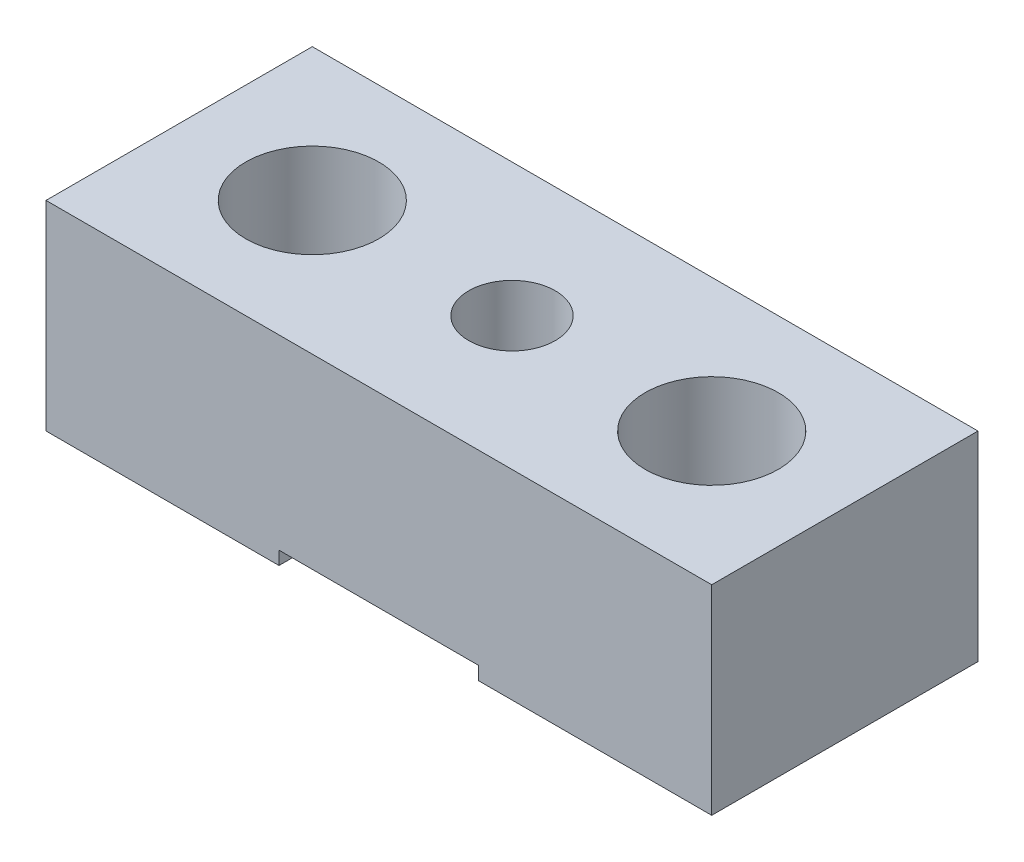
ISO-10303-21;
HEADER;
FILE_DESCRIPTION(('STEP AP214'),'2;1');
FILE_NAME('part.step','',(''),(''),'','','');
FILE_SCHEMA(('AUTOMOTIVE_DESIGN { 1 0 10303 214 1 1 1 1 }'));
ENDSEC;
DATA;
#1=APPLICATION_CONTEXT('core data for automotive mechanical design processes');
#2=APPLICATION_PROTOCOL_DEFINITION('international standard','automotive_design',2000,#1);
#3=PRODUCT_CONTEXT('',#1,'mechanical');
#4=PRODUCT('Part','Part','',(#3));
#5=PRODUCT_RELATED_PRODUCT_CATEGORY('part','',(#4));
#6=PRODUCT_DEFINITION_FORMATION('','',#4);
#7=PRODUCT_DEFINITION_CONTEXT('part definition',#1,'design');
#8=PRODUCT_DEFINITION('design','',#6,#7);
#9=PRODUCT_DEFINITION_SHAPE('','',#8);
#10=(LENGTH_UNIT() NAMED_UNIT(*) SI_UNIT(.MILLI.,.METRE.));
#11=(NAMED_UNIT(*) PLANE_ANGLE_UNIT() SI_UNIT($,.RADIAN.));
#12=(NAMED_UNIT(*) SI_UNIT($,.STERADIAN.) SOLID_ANGLE_UNIT());
#13=UNCERTAINTY_MEASURE_WITH_UNIT(LENGTH_MEASURE(1.E-05),#10,'distance_accuracy_value','');
#14=(GEOMETRIC_REPRESENTATION_CONTEXT(3) GLOBAL_UNCERTAINTY_ASSIGNED_CONTEXT((#13)) GLOBAL_UNIT_ASSIGNED_CONTEXT((#10,
#11,#12)) REPRESENTATION_CONTEXT('',''));
#15=CARTESIAN_POINT('',(0.,0.,0.));
#16=DIRECTION('',(0.,0.,1.));
#17=DIRECTION('',(1.,0.,0.));
#18=AXIS2_PLACEMENT_3D('',#15,#16,#17);
#19=CARTESIAN_POINT('',(0.,-14.9999999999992,10.));
#20=DIRECTION('',(1.,0.,0.));
#21=DIRECTION('',(0.,0.,-1.));
#22=AXIS2_PLACEMENT_3D('',#19,#20,#21);
#23=PLANE('',#22);
#24=DIRECTION('',(0.,-1.,0.));
#25=VECTOR('',#24,1.);
#26=CARTESIAN_POINT('',(0.,-14.9999999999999,-10.));
#27=LINE('',#26,#25);
#28=CARTESIAN_POINT('',(0.,0.,-10.));
#29=VERTEX_POINT('',#28);
#30=CARTESIAN_POINT('',(0.,-14.9999999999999,-10.));
#31=VERTEX_POINT('',#30);
#32=EDGE_CURVE('E107',#29,#31,#27,.T.);
#33=ORIENTED_EDGE('',*,*,#32,.T.);
#34=DIRECTION('',(0.,0.,-1.));
#35=VECTOR('',#34,1.);
#36=CARTESIAN_POINT('',(0.,-14.9999999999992,10.));
#37=LINE('',#36,#35);
#38=CARTESIAN_POINT('',(0.,-14.9999999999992,10.));
#39=VERTEX_POINT('',#38);
#40=EDGE_CURVE('E11',#39,#31,#37,.T.);
#41=ORIENTED_EDGE('',*,*,#40,.F.);
#42=DIRECTION('',(0.,-1.,0.));
#43=VECTOR('',#42,1.);
#44=CARTESIAN_POINT('',(0.,-14.9999999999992,10.));
#45=LINE('',#44,#43);
#46=CARTESIAN_POINT('',(0.,6.66133814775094E-13,10.));
#47=VERTEX_POINT('',#46);
#48=EDGE_CURVE('E149',#47,#39,#45,.T.);
#49=ORIENTED_EDGE('',*,*,#48,.F.);
#50=DIRECTION('',(0.,0.,-1.));
#51=VECTOR('',#50,1.);
#52=CARTESIAN_POINT('',(0.,6.66133814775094E-13,10.));
#53=LINE('',#52,#51);
#54=EDGE_CURVE('E121',#47,#29,#53,.T.);
#55=ORIENTED_EDGE('',*,*,#54,.T.);
#56=EDGE_LOOP('',(#33,#41,#49,#55));
#57=FACE_BOUND('',#56,.T.);
#58=ADVANCED_FACE('F38',(#57),#23,.F.);
#59=CARTESIAN_POINT('',(17.5,-14.9999999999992,10.));
#60=DIRECTION('',(0.,1.,0.));
#61=DIRECTION('',(-1.,0.,0.));
#62=AXIS2_PLACEMENT_3D('',#59,#60,#61);
#63=PLANE('',#62);
#64=CARTESIAN_POINT('',(10.,-14.9999999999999,0.));
#65=DIRECTION('',(0.,1.,0.));
#66=DIRECTION('',(-1.,0.,0.));
#67=AXIS2_PLACEMENT_3D('',#64,#65,#66);
#68=CIRCLE('',#67,5.);
#69=CARTESIAN_POINT('',(10.,-14.9999999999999,5.));
#70=VERTEX_POINT('',#69);
#71=EDGE_CURVE('E123',#70,#70,#68,.F.);
#72=ORIENTED_EDGE('',*,*,#71,.F.);
#73=EDGE_LOOP('',(#72));
#74=FACE_BOUND('',#73,.T.);
#75=DIRECTION('',(1.,0.,0.));
#76=VECTOR('',#75,1.);
#77=CARTESIAN_POINT('',(17.5,-14.9999999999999,-10.));
#78=LINE('',#77,#76);
#79=CARTESIAN_POINT('',(17.5,-14.9999999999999,-10.));
#80=VERTEX_POINT('',#79);
#81=EDGE_CURVE('E103',#31,#80,#78,.T.);
#82=ORIENTED_EDGE('',*,*,#81,.T.);
#83=DIRECTION('',(0.,0.,-1.));
#84=VECTOR('',#83,1.);
#85=CARTESIAN_POINT('',(17.5,-14.9999999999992,10.));
#86=LINE('',#85,#84);
#87=CARTESIAN_POINT('',(17.5,-14.9999999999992,10.));
#88=VERTEX_POINT('',#87);
#89=EDGE_CURVE('E46',#88,#80,#86,.T.);
#90=ORIENTED_EDGE('',*,*,#89,.F.);
#91=DIRECTION('',(1.,0.,0.));
#92=VECTOR('',#91,1.);
#93=CARTESIAN_POINT('',(17.5,-14.9999999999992,10.));
#94=LINE('',#93,#92);
#95=EDGE_CURVE('E117',#39,#88,#94,.T.);
#96=ORIENTED_EDGE('',*,*,#95,.F.);
#97=ORIENTED_EDGE('',*,*,#40,.T.);
#98=EDGE_LOOP('',(#82,#90,#96,#97));
#99=FACE_BOUND('',#98,.T.);
#100=ADVANCED_FACE('F116',(#74,#99),#63,.F.);
#101=CARTESIAN_POINT('',(17.5,-13.9999999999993,10.));
#102=DIRECTION('',(-1.,0.,0.));
#103=DIRECTION('',(0.,0.,1.));
#104=AXIS2_PLACEMENT_3D('',#101,#102,#103);
#105=PLANE('',#104);
#106=DIRECTION('',(0.,1.,0.));
#107=VECTOR('',#106,1.);
#108=CARTESIAN_POINT('',(17.5,-14.,-10.));
#109=LINE('',#108,#107);
#110=CARTESIAN_POINT('',(17.5,-14.,-10.));
#111=VERTEX_POINT('',#110);
#112=EDGE_CURVE('E109',#80,#111,#109,.T.);
#113=ORIENTED_EDGE('',*,*,#112,.T.);
#114=DIRECTION('',(0.,0.,-1.));
#115=VECTOR('',#114,1.);
#116=CARTESIAN_POINT('',(17.5,-13.9999999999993,10.));
#117=LINE('',#116,#115);
#118=CARTESIAN_POINT('',(17.5,-13.9999999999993,10.));
#119=VERTEX_POINT('',#118);
#120=EDGE_CURVE('E188',#119,#111,#117,.T.);
#121=ORIENTED_EDGE('',*,*,#120,.F.);
#122=DIRECTION('',(0.,1.,0.));
#123=VECTOR('',#122,1.);
#124=CARTESIAN_POINT('',(17.5,-13.9999999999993,10.));
#125=LINE('',#124,#123);
#126=EDGE_CURVE('E154',#88,#119,#125,.T.);
#127=ORIENTED_EDGE('',*,*,#126,.F.);
#128=ORIENTED_EDGE('',*,*,#89,.T.);
#129=EDGE_LOOP('',(#113,#121,#127,#128));
#130=FACE_BOUND('',#129,.T.);
#131=ADVANCED_FACE('F194',(#130),#105,.F.);
#132=CARTESIAN_POINT('',(32.5,-13.9999999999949,10.));
#133=DIRECTION('',(0.,1.,0.));
#134=DIRECTION('',(-1.,0.,0.));
#135=AXIS2_PLACEMENT_3D('',#132,#133,#134);
#136=PLANE('',#135);
#137=CARTESIAN_POINT('',(25.,-14.,0.));
#138=DIRECTION('',(0.,1.,0.));
#139=DIRECTION('',(-1.,0.,0.));
#140=AXIS2_PLACEMENT_3D('',#137,#138,#139);
#141=CIRCLE('',#140,3.25);
#142=CARTESIAN_POINT('',(25.,-14.,3.25));
#143=VERTEX_POINT('',#142);
#144=EDGE_CURVE('E257',#143,#143,#141,.F.);
#145=ORIENTED_EDGE('',*,*,#144,.F.);
#146=EDGE_LOOP('',(#145));
#147=FACE_BOUND('',#146,.T.);
#148=DIRECTION('',(1.,0.,0.));
#149=VECTOR('',#148,1.);
#150=CARTESIAN_POINT('',(32.5,-13.9999999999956,-10.));
#151=LINE('',#150,#149);
#152=CARTESIAN_POINT('',(32.5,-13.9999999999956,-10.));
#153=VERTEX_POINT('',#152);
#154=EDGE_CURVE('E134',#111,#153,#151,.T.);
#155=ORIENTED_EDGE('',*,*,#154,.T.);
#156=DIRECTION('',(0.,0.,-1.));
#157=VECTOR('',#156,1.);
#158=CARTESIAN_POINT('',(32.5,-13.9999999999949,10.));
#159=LINE('',#158,#157);
#160=CARTESIAN_POINT('',(32.5,-13.9999999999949,10.));
#161=VERTEX_POINT('',#160);
#162=EDGE_CURVE('E184',#161,#153,#159,.T.);
#163=ORIENTED_EDGE('',*,*,#162,.F.);
#164=DIRECTION('',(1.,0.,0.));
#165=VECTOR('',#164,1.);
#166=CARTESIAN_POINT('',(32.5,-13.9999999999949,10.));
#167=LINE('',#166,#165);
#168=EDGE_CURVE('E157',#119,#161,#167,.T.);
#169=ORIENTED_EDGE('',*,*,#168,.F.);
#170=ORIENTED_EDGE('',*,*,#120,.T.);
#171=EDGE_LOOP('',(#155,#163,#169,#170));
#172=FACE_BOUND('',#171,.T.);
#173=ADVANCED_FACE('F202',(#147,#172),#136,.F.);
#174=CARTESIAN_POINT('',(32.5,-13.9999999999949,10.));
#175=DIRECTION('',(1.,0.,0.));
#176=DIRECTION('',(0.,0.,-1.));
#177=AXIS2_PLACEMENT_3D('',#174,#175,#176);
#178=PLANE('',#177);
#179=DIRECTION('',(0.,-1.,0.));
#180=VECTOR('',#179,1.);
#181=CARTESIAN_POINT('',(32.5,-13.9999999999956,-10.));
#182=LINE('',#181,#180);
#183=CARTESIAN_POINT('',(32.5,-14.9999999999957,-10.));
#184=VERTEX_POINT('',#183);
#185=EDGE_CURVE('E137',#153,#184,#182,.T.);
#186=ORIENTED_EDGE('',*,*,#185,.T.);
#187=DIRECTION('',(0.,0.,-1.));
#188=VECTOR('',#187,1.);
#189=CARTESIAN_POINT('',(32.5,-14.999999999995,10.));
#190=LINE('',#189,#188);
#191=CARTESIAN_POINT('',(32.5,-14.999999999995,10.));
#192=VERTEX_POINT('',#191);
#193=EDGE_CURVE('E180',#192,#184,#190,.T.);
#194=ORIENTED_EDGE('',*,*,#193,.F.);
#195=DIRECTION('',(0.,-1.,0.));
#196=VECTOR('',#195,1.);
#197=CARTESIAN_POINT('',(32.5,-13.9999999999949,10.));
#198=LINE('',#197,#196);
#199=EDGE_CURVE('E160',#161,#192,#198,.T.);
#200=ORIENTED_EDGE('',*,*,#199,.F.);
#201=ORIENTED_EDGE('',*,*,#162,.T.);
#202=EDGE_LOOP('',(#186,#194,#200,#201));
#203=FACE_BOUND('',#202,.T.);
#204=ADVANCED_FACE('F205',(#203),#178,.F.);
#205=CARTESIAN_POINT('',(32.5,-14.999999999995,10.));
#206=DIRECTION('',(0.,1.,0.));
#207=DIRECTION('',(-1.,0.,0.));
#208=AXIS2_PLACEMENT_3D('',#205,#206,#207);
#209=PLANE('',#208);
#210=CARTESIAN_POINT('',(40.,-14.9999999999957,0.));
#211=DIRECTION('',(0.,1.,0.));
#212=DIRECTION('',(-1.,0.,0.));
#213=AXIS2_PLACEMENT_3D('',#210,#211,#212);
#214=CIRCLE('',#213,5.);
#215=CARTESIAN_POINT('',(40.,-14.9999999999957,5.));
#216=VERTEX_POINT('',#215);
#217=EDGE_CURVE('E249',#216,#216,#214,.F.);
#218=ORIENTED_EDGE('',*,*,#217,.F.);
#219=EDGE_LOOP('',(#218));
#220=FACE_BOUND('',#219,.T.);
#221=DIRECTION('',(1.,0.,0.));
#222=VECTOR('',#221,1.);
#223=CARTESIAN_POINT('',(32.5,-14.9999999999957,-10.));
#224=LINE('',#223,#222);
#225=CARTESIAN_POINT('',(50.,-14.9999999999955,-10.));
#226=VERTEX_POINT('',#225);
#227=EDGE_CURVE('E140',#184,#226,#224,.T.);
#228=ORIENTED_EDGE('',*,*,#227,.T.);
#229=DIRECTION('',(0.,0.,-1.));
#230=VECTOR('',#229,1.);
#231=CARTESIAN_POINT('',(50.,-14.9999999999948,10.));
#232=LINE('',#231,#230);
#233=CARTESIAN_POINT('',(50.,-14.9999999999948,10.));
#234=VERTEX_POINT('',#233);
#235=EDGE_CURVE('E176',#234,#226,#232,.T.);
#236=ORIENTED_EDGE('',*,*,#235,.F.);
#237=DIRECTION('',(1.,0.,0.));
#238=VECTOR('',#237,1.);
#239=CARTESIAN_POINT('',(32.5,-14.999999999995,10.));
#240=LINE('',#239,#238);
#241=EDGE_CURVE('E163',#192,#234,#240,.T.);
#242=ORIENTED_EDGE('',*,*,#241,.F.);
#243=ORIENTED_EDGE('',*,*,#193,.T.);
#244=EDGE_LOOP('',(#228,#236,#242,#243));
#245=FACE_BOUND('',#244,.T.);
#246=ADVANCED_FACE('F210',(#220,#245),#209,.F.);
#247=CARTESIAN_POINT('',(50.,5.10702591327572E-12,10.));
#248=DIRECTION('',(-1.,0.,0.));
#249=DIRECTION('',(0.,0.,1.));
#250=AXIS2_PLACEMENT_3D('',#247,#248,#249);
#251=PLANE('',#250);
#252=DIRECTION('',(0.,1.,0.));
#253=VECTOR('',#252,1.);
#254=CARTESIAN_POINT('',(50.,4.44089209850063E-12,-10.));
#255=LINE('',#254,#253);
#256=CARTESIAN_POINT('',(50.,4.44089209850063E-12,-10.));
#257=VERTEX_POINT('',#256);
#258=EDGE_CURVE('E143',#226,#257,#255,.T.);
#259=ORIENTED_EDGE('',*,*,#258,.T.);
#260=DIRECTION('',(0.,0.,-1.));
#261=VECTOR('',#260,1.);
#262=CARTESIAN_POINT('',(50.,5.10702591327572E-12,10.));
#263=LINE('',#262,#261);
#264=CARTESIAN_POINT('',(50.,5.10702591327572E-12,10.));
#265=VERTEX_POINT('',#264);
#266=EDGE_CURVE('E172',#265,#257,#263,.T.);
#267=ORIENTED_EDGE('',*,*,#266,.F.);
#268=DIRECTION('',(0.,1.,0.));
#269=VECTOR('',#268,1.);
#270=CARTESIAN_POINT('',(50.,5.10702591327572E-12,10.));
#271=LINE('',#270,#269);
#272=EDGE_CURVE('E58',#234,#265,#271,.T.);
#273=ORIENTED_EDGE('',*,*,#272,.F.);
#274=ORIENTED_EDGE('',*,*,#235,.T.);
#275=EDGE_LOOP('',(#259,#267,#273,#274));
#276=FACE_BOUND('',#275,.T.);
#277=ADVANCED_FACE('F213',(#276),#251,.F.);
#278=CARTESIAN_POINT('',(0.,6.66133814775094E-13,10.));
#279=DIRECTION('',(0.,-1.,0.));
#280=DIRECTION('',(0.,0.,-1.));
#281=AXIS2_PLACEMENT_3D('',#278,#279,#280);
#282=PLANE('',#281);
#283=CARTESIAN_POINT('',(40.,4.44089209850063E-12,0.));
#284=DIRECTION('',(0.,1.,0.));
#285=DIRECTION('',(0.,0.,1.));
#286=AXIS2_PLACEMENT_3D('',#283,#284,#285);
#287=CIRCLE('',#286,5.);
#288=CARTESIAN_POINT('',(40.,4.4426268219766E-12,4.99999999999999));
#289=VERTEX_POINT('',#288);
#290=EDGE_CURVE('E252',#289,#289,#287,.T.);
#291=ORIENTED_EDGE('',*,*,#290,.F.);
#292=EDGE_LOOP('',(#291));
#293=FACE_BOUND('',#292,.T.);
#294=CARTESIAN_POINT('',(25.,0.,0.));
#295=DIRECTION('',(0.,1.,0.));
#296=DIRECTION('',(0.,0.,1.));
#297=AXIS2_PLACEMENT_3D('',#294,#295,#296);
#298=CIRCLE('',#297,3.25);
#299=CARTESIAN_POINT('',(25.,0.,3.25));
#300=VERTEX_POINT('',#299);
#301=EDGE_CURVE('E251',#300,#300,#298,.T.);
#302=ORIENTED_EDGE('',*,*,#301,.F.);
#303=EDGE_LOOP('',(#302));
#304=FACE_BOUND('',#303,.T.);
#305=CARTESIAN_POINT('',(10.,0.,0.));
#306=DIRECTION('',(0.,1.,0.));
#307=DIRECTION('',(0.,0.,1.));
#308=AXIS2_PLACEMENT_3D('',#305,#306,#307);
#309=CIRCLE('',#308,5.);
#310=CARTESIAN_POINT('',(10.,0.,5.));
#311=VERTEX_POINT('',#310);
#312=EDGE_CURVE('E128',#311,#311,#309,.T.);
#313=ORIENTED_EDGE('',*,*,#312,.F.);
#314=EDGE_LOOP('',(#313));
#315=FACE_BOUND('',#314,.T.);
#316=DIRECTION('',(-1.,0.,0.));
#317=VECTOR('',#316,1.);
#318=CARTESIAN_POINT('',(0.,0.,-10.));
#319=LINE('',#318,#317);
#320=EDGE_CURVE('E146',#257,#29,#319,.T.);
#321=ORIENTED_EDGE('',*,*,#320,.T.);
#322=ORIENTED_EDGE('',*,*,#54,.F.);
#323=DIRECTION('',(-1.,0.,0.));
#324=VECTOR('',#323,1.);
#325=CARTESIAN_POINT('',(0.,6.66133814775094E-13,10.));
#326=LINE('',#325,#324);
#327=EDGE_CURVE('E53',#265,#47,#326,.T.);
#328=ORIENTED_EDGE('',*,*,#327,.F.);
#329=ORIENTED_EDGE('',*,*,#266,.T.);
#330=EDGE_LOOP('',(#321,#322,#328,#329));
#331=FACE_BOUND('',#330,.T.);
#332=ADVANCED_FACE('F215',(#293,#304,#315,#331),#282,.F.);
#333=CARTESIAN_POINT('',(0.,6.66133814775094E-13,10.));
#334=DIRECTION('',(0.,0.,-1.));
#335=DIRECTION('',(-1.,0.,0.));
#336=AXIS2_PLACEMENT_3D('',#333,#334,#335);
#337=PLANE('',#336);
#338=ORIENTED_EDGE('',*,*,#48,.T.);
#339=ORIENTED_EDGE('',*,*,#95,.T.);
#340=ORIENTED_EDGE('',*,*,#126,.T.);
#341=ORIENTED_EDGE('',*,*,#168,.T.);
#342=ORIENTED_EDGE('',*,*,#199,.T.);
#343=ORIENTED_EDGE('',*,*,#241,.T.);
#344=ORIENTED_EDGE('',*,*,#272,.T.);
#345=ORIENTED_EDGE('',*,*,#327,.T.);
#346=EDGE_LOOP('',(#338,#339,#340,#341,#342,#343,#344,#345));
#347=FACE_BOUND('',#346,.T.);
#348=ADVANCED_FACE('F197',(#347),#337,.F.);
#349=CARTESIAN_POINT('',(0.,0.,-10.));
#350=DIRECTION('',(0.,0.,-1.));
#351=DIRECTION('',(-1.,0.,0.));
#352=AXIS2_PLACEMENT_3D('',#349,#350,#351);
#353=PLANE('',#352);
#354=ORIENTED_EDGE('',*,*,#32,.F.);
#355=ORIENTED_EDGE('',*,*,#320,.F.);
#356=ORIENTED_EDGE('',*,*,#258,.F.);
#357=ORIENTED_EDGE('',*,*,#227,.F.);
#358=ORIENTED_EDGE('',*,*,#185,.F.);
#359=ORIENTED_EDGE('',*,*,#154,.F.);
#360=ORIENTED_EDGE('',*,*,#112,.F.);
#361=ORIENTED_EDGE('',*,*,#81,.F.);
#362=EDGE_LOOP('',(#354,#355,#356,#357,#358,#359,#360,#361));
#363=FACE_BOUND('',#362,.T.);
#364=ADVANCED_FACE('F104',(#363),#353,.T.);
#365=CARTESIAN_POINT('',(10.,-15.001,0.));
#366=DIRECTION('',(0.,1.,0.));
#367=DIRECTION('',(0.,0.,1.));
#368=AXIS2_PLACEMENT_3D('',#365,#366,#367);
#369=CYLINDRICAL_SURFACE('',#368,5.);
#370=CARTESIAN_POINT('',(10.,0.,5.));
#371=CARTESIAN_POINT('',(10.,-0.156249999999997,5.));
#372=CARTESIAN_POINT('',(10.,-0.312499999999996,5.));
#373=CARTESIAN_POINT('',(10.,-0.624999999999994,5.));
#374=CARTESIAN_POINT('',(10.,-0.781249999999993,5.));
#375=CARTESIAN_POINT('',(10.,-1.09374999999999,5.));
#376=CARTESIAN_POINT('',(10.,-1.24999999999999,5.));
#377=CARTESIAN_POINT('',(10.,-1.56249999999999,5.));
#378=CARTESIAN_POINT('',(10.,-1.71874999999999,5.));
#379=CARTESIAN_POINT('',(10.,-2.03124999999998,5.));
#380=CARTESIAN_POINT('',(10.,-2.18749999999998,5.));
#381=CARTESIAN_POINT('',(10.,-2.49999999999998,5.));
#382=CARTESIAN_POINT('',(10.,-2.65624999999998,5.));
#383=CARTESIAN_POINT('',(10.,-2.96874999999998,5.));
#384=CARTESIAN_POINT('',(10.,-3.12499999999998,5.));
#385=CARTESIAN_POINT('',(10.,-3.43749999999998,5.));
#386=CARTESIAN_POINT('',(10.,-3.59374999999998,5.));
#387=CARTESIAN_POINT('',(10.,-3.90624999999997,5.));
#388=CARTESIAN_POINT('',(10.,-4.06249999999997,5.));
#389=CARTESIAN_POINT('',(10.,-4.37499999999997,5.));
#390=CARTESIAN_POINT('',(10.,-4.53124999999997,5.));
#391=CARTESIAN_POINT('',(10.,-4.84374999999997,5.));
#392=CARTESIAN_POINT('',(10.,-4.99999999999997,5.));
#393=CARTESIAN_POINT('',(10.,-5.31249999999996,5.));
#394=CARTESIAN_POINT('',(10.,-5.46874999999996,5.));
#395=CARTESIAN_POINT('',(10.,-5.78124999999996,5.));
#396=CARTESIAN_POINT('',(10.,-5.93749999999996,5.));
#397=CARTESIAN_POINT('',(10.,-6.24999999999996,5.));
#398=CARTESIAN_POINT('',(10.,-6.40624999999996,5.));
#399=CARTESIAN_POINT('',(10.,-6.71874999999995,5.));
#400=CARTESIAN_POINT('',(10.,-6.87499999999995,5.));
#401=CARTESIAN_POINT('',(10.,-7.18749999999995,5.));
#402=CARTESIAN_POINT('',(10.,-7.34374999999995,5.));
#403=CARTESIAN_POINT('',(10.,-7.65624999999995,5.));
#404=CARTESIAN_POINT('',(10.,-7.81249999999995,5.));
#405=CARTESIAN_POINT('',(10.,-8.12499999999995,5.));
#406=CARTESIAN_POINT('',(10.,-8.28124999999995,5.));
#407=CARTESIAN_POINT('',(10.,-8.59374999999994,5.));
#408=CARTESIAN_POINT('',(10.,-8.74999999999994,5.));
#409=CARTESIAN_POINT('',(10.,-9.06249999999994,5.));
#410=CARTESIAN_POINT('',(10.,-9.21874999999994,5.));
#411=CARTESIAN_POINT('',(10.,-9.53124999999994,5.));
#412=CARTESIAN_POINT('',(10.,-9.68749999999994,5.));
#413=CARTESIAN_POINT('',(10.,-9.99999999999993,5.));
#414=CARTESIAN_POINT('',(10.,-10.1562499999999,5.));
#415=CARTESIAN_POINT('',(10.,-10.4687499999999,5.));
#416=CARTESIAN_POINT('',(10.,-10.6249999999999,5.));
#417=CARTESIAN_POINT('',(10.,-10.9374999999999,5.));
#418=CARTESIAN_POINT('',(10.,-11.0937499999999,5.));
#419=CARTESIAN_POINT('',(10.,-11.4062499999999,5.));
#420=CARTESIAN_POINT('',(10.,-11.5624999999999,5.));
#421=CARTESIAN_POINT('',(10.,-11.8749999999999,5.));
#422=CARTESIAN_POINT('',(10.,-12.0312499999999,5.));
#423=CARTESIAN_POINT('',(10.,-12.3437499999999,5.));
#424=CARTESIAN_POINT('',(10.,-12.4999999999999,5.));
#425=CARTESIAN_POINT('',(10.,-12.8124999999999,5.));
#426=CARTESIAN_POINT('',(10.,-12.9687499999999,5.));
#427=CARTESIAN_POINT('',(10.,-13.2812499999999,5.));
#428=CARTESIAN_POINT('',(10.,-13.4374999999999,5.));
#429=CARTESIAN_POINT('',(10.,-13.7499999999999,5.));
#430=CARTESIAN_POINT('',(10.,-13.9062499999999,5.));
#431=CARTESIAN_POINT('',(10.,-14.2187499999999,5.));
#432=CARTESIAN_POINT('',(10.,-14.3749999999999,5.));
#433=CARTESIAN_POINT('',(10.,-14.6874999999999,5.));
#434=CARTESIAN_POINT('',(10.,-14.8437499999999,5.));
#435=CARTESIAN_POINT('',(10.,-14.9999999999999,5.));
#436=B_SPLINE_CURVE_WITH_KNOTS('',3,(#370,#371,#372,#373,#374,#375,#376,#377,#378,#379,#380,
#381,#382,#383,#384,#385,#386,#387,#388,#389,#390,#391,#392,#393,#394,#395,#396,#397,#398,#399,
#400,#401,#402,#403,#404,#405,#406,#407,#408,#409,#410,#411,#412,#413,#414,#415,#416,#417,#418,
#419,#420,#421,#422,#423,#424,#425,#426,#427,#428,#429,#430,#431,#432,#433,#434,#435),
.UNSPECIFIED.,.F.,.F.,(4,2,2,2,2,2,2,2,2,2,2,2,2,2,2,2,2,2,2,2,2,2,2,2,2,2,2,2,2,2,2,2,4),(0.,
0.468749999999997,0.937499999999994,1.40624999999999,1.87499999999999,2.34374999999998,
2.81249999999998,3.28124999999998,3.74999999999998,4.21874999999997,4.68749999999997,
5.15624999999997,5.62499999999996,6.09374999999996,6.56249999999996,7.03124999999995,
7.49999999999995,7.96874999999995,8.43749999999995,8.90624999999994,9.37499999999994,
9.84374999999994,10.3124999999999,10.7812499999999,11.2499999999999,11.7187499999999,
12.1874999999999,12.6562499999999,13.1249999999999,13.5937499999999,14.0624999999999,
14.5312499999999,14.9999999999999),.UNSPECIFIED.);
#437=EDGE_CURVE('BSEAM268',#311,#70,#436,.T.);
#438=ORIENTED_EDGE('',*,*,#312,.T.);
#439=ORIENTED_EDGE('',*,*,#71,.T.);
#440=ORIENTED_EDGE('',*,*,#437,.T.);
#441=ORIENTED_EDGE('',*,*,#437,.F.);
#442=EDGE_LOOP('',(#438,#440,#439,#441));
#443=FACE_BOUND('',#442,.T.);
#444=ADVANCED_FACE('F268',(#443),#369,.F.);
#445=CARTESIAN_POINT('',(25.,-15.0009999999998,0.));
#446=DIRECTION('',(0.,1.,0.));
#447=DIRECTION('',(0.,0.,1.));
#448=AXIS2_PLACEMENT_3D('',#445,#446,#447);
#449=CYLINDRICAL_SURFACE('',#448,3.25);
#450=CARTESIAN_POINT('',(25.,0.,3.25));
#451=CARTESIAN_POINT('',(25.,-0.145833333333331,3.25));
#452=CARTESIAN_POINT('',(25.,-0.291666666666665,3.25));
#453=CARTESIAN_POINT('',(25.,-0.583333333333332,3.25));
#454=CARTESIAN_POINT('',(25.,-0.729166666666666,3.25));
#455=CARTESIAN_POINT('',(25.,-1.02083333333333,3.25));
#456=CARTESIAN_POINT('',(25.,-1.16666666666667,3.25));
#457=CARTESIAN_POINT('',(25.,-1.45833333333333,3.25));
#458=CARTESIAN_POINT('',(25.,-1.60416666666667,3.25));
#459=CARTESIAN_POINT('',(25.,-1.89583333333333,3.25));
#460=CARTESIAN_POINT('',(25.,-2.04166666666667,3.25));
#461=CARTESIAN_POINT('',(25.,-2.33333333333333,3.25));
#462=CARTESIAN_POINT('',(25.,-2.47916666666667,3.25));
#463=CARTESIAN_POINT('',(25.,-2.77083333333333,3.25));
#464=CARTESIAN_POINT('',(25.,-2.91666666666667,3.25));
#465=CARTESIAN_POINT('',(25.,-3.20833333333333,3.25));
#466=CARTESIAN_POINT('',(25.,-3.35416666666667,3.25));
#467=CARTESIAN_POINT('',(25.,-3.64583333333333,3.25));
#468=CARTESIAN_POINT('',(25.,-3.79166666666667,3.25));
#469=CARTESIAN_POINT('',(25.,-4.08333333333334,3.25));
#470=CARTESIAN_POINT('',(25.,-4.22916666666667,3.25));
#471=CARTESIAN_POINT('',(25.,-4.52083333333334,3.25));
#472=CARTESIAN_POINT('',(25.,-4.66666666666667,3.25));
#473=CARTESIAN_POINT('',(25.,-4.95833333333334,3.25));
#474=CARTESIAN_POINT('',(25.,-5.10416666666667,3.25));
#475=CARTESIAN_POINT('',(25.,-5.39583333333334,3.25));
#476=CARTESIAN_POINT('',(25.,-5.54166666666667,3.25));
#477=CARTESIAN_POINT('',(25.,-5.83333333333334,3.25));
#478=CARTESIAN_POINT('',(25.,-5.97916666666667,3.25));
#479=CARTESIAN_POINT('',(25.,-6.27083333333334,3.25));
#480=CARTESIAN_POINT('',(25.,-6.41666666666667,3.25));
#481=CARTESIAN_POINT('',(25.,-6.70833333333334,3.25));
#482=CARTESIAN_POINT('',(25.,-6.85416666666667,3.25));
#483=CARTESIAN_POINT('',(25.,-7.14583333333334,3.25));
#484=CARTESIAN_POINT('',(25.,-7.29166666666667,3.25));
#485=CARTESIAN_POINT('',(25.,-7.58333333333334,3.25));
#486=CARTESIAN_POINT('',(25.,-7.72916666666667,3.25));
#487=CARTESIAN_POINT('',(25.,-8.02083333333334,3.25));
#488=CARTESIAN_POINT('',(25.,-8.16666666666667,3.25));
#489=CARTESIAN_POINT('',(25.,-8.45833333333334,3.25));
#490=CARTESIAN_POINT('',(25.,-8.60416666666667,3.25));
#491=CARTESIAN_POINT('',(25.,-8.89583333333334,3.25));
#492=CARTESIAN_POINT('',(25.,-9.04166666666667,3.25));
#493=CARTESIAN_POINT('',(25.,-9.33333333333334,3.25));
#494=CARTESIAN_POINT('',(25.,-9.47916666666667,3.25));
#495=CARTESIAN_POINT('',(25.,-9.77083333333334,3.25));
#496=CARTESIAN_POINT('',(25.,-9.91666666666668,3.25));
#497=CARTESIAN_POINT('',(25.,-10.2083333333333,3.25));
#498=CARTESIAN_POINT('',(25.,-10.3541666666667,3.25));
#499=CARTESIAN_POINT('',(25.,-10.6458333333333,3.25));
#500=CARTESIAN_POINT('',(25.,-10.7916666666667,3.25));
#501=CARTESIAN_POINT('',(25.,-11.0833333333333,3.25));
#502=CARTESIAN_POINT('',(25.,-11.2291666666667,3.25));
#503=CARTESIAN_POINT('',(25.,-11.5208333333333,3.25));
#504=CARTESIAN_POINT('',(25.,-11.6666666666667,3.25));
#505=CARTESIAN_POINT('',(25.,-11.9583333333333,3.25));
#506=CARTESIAN_POINT('',(25.,-12.1041666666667,3.25));
#507=CARTESIAN_POINT('',(25.,-12.3958333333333,3.25));
#508=CARTESIAN_POINT('',(25.,-12.5416666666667,3.25));
#509=CARTESIAN_POINT('',(25.,-12.8333333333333,3.25));
#510=CARTESIAN_POINT('',(25.,-12.9791666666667,3.25));
#511=CARTESIAN_POINT('',(25.,-13.2708333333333,3.25));
#512=CARTESIAN_POINT('',(25.,-13.4166666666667,3.25));
#513=CARTESIAN_POINT('',(25.,-13.7083333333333,3.25));
#514=CARTESIAN_POINT('',(25.,-13.8541666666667,3.25));
#515=CARTESIAN_POINT('',(25.,-14.,3.25));
#516=B_SPLINE_CURVE_WITH_KNOTS('',3,(#450,#451,#452,#453,#454,#455,#456,#457,#458,#459,#460,
#461,#462,#463,#464,#465,#466,#467,#468,#469,#470,#471,#472,#473,#474,#475,#476,#477,#478,#479,
#480,#481,#482,#483,#484,#485,#486,#487,#488,#489,#490,#491,#492,#493,#494,#495,#496,#497,#498,
#499,#500,#501,#502,#503,#504,#505,#506,#507,#508,#509,#510,#511,#512,#513,#514,#515),
.UNSPECIFIED.,.F.,.F.,(4,2,2,2,2,2,2,2,2,2,2,2,2,2,2,2,2,2,2,2,2,2,2,2,2,2,2,2,2,2,2,2,4),(0.,
0.4375,0.875000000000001,1.3125,1.75,2.1875,2.625,3.0625,3.5,3.9375,4.375,4.8125,5.25,
5.68750000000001,6.12500000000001,6.56250000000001,7.00000000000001,7.43750000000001,
7.87500000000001,8.31250000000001,8.75000000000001,9.18750000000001,9.62500000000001,10.0625,
10.5,10.9375,11.375,11.8125,12.25,12.6875,13.125,13.5625,14.),.UNSPECIFIED.);
#517=EDGE_CURVE('BSEAM272',#300,#143,#516,.T.);
#518=ORIENTED_EDGE('',*,*,#301,.T.);
#519=ORIENTED_EDGE('',*,*,#144,.T.);
#520=ORIENTED_EDGE('',*,*,#517,.T.);
#521=ORIENTED_EDGE('',*,*,#517,.F.);
#522=EDGE_LOOP('',(#518,#520,#519,#521));
#523=FACE_BOUND('',#522,.T.);
#524=ADVANCED_FACE('F272',(#523),#449,.F.);
#525=CARTESIAN_POINT('',(40.,-15.0009999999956,0.));
#526=DIRECTION('',(0.,1.,0.));
#527=DIRECTION('',(0.,0.,1.));
#528=AXIS2_PLACEMENT_3D('',#525,#526,#527);
#529=CYLINDRICAL_SURFACE('',#528,5.);
#530=CARTESIAN_POINT('',(40.,4.4426268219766E-12,4.99999999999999));
#531=CARTESIAN_POINT('',(40.,-0.156249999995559,4.99999999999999));
#532=CARTESIAN_POINT('',(40.,-0.31249999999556,4.99999999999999));
#533=CARTESIAN_POINT('',(40.,-0.624999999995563,4.99999999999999));
#534=CARTESIAN_POINT('',(40.,-0.781249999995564,5.));
#535=CARTESIAN_POINT('',(40.,-1.09374999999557,5.));
#536=CARTESIAN_POINT('',(40.,-1.24999999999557,5.));
#537=CARTESIAN_POINT('',(40.,-1.56249999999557,5.));
#538=CARTESIAN_POINT('',(40.,-1.71874999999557,5.));
#539=CARTESIAN_POINT('',(40.,-2.03124999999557,5.));
#540=CARTESIAN_POINT('',(40.,-2.18749999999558,5.));
#541=CARTESIAN_POINT('',(40.,-2.49999999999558,5.));
#542=CARTESIAN_POINT('',(40.,-2.65624999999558,5.));
#543=CARTESIAN_POINT('',(40.,-2.96874999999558,5.));
#544=CARTESIAN_POINT('',(40.,-3.12499999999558,5.));
#545=CARTESIAN_POINT('',(40.,-3.43749999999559,5.));
#546=CARTESIAN_POINT('',(40.,-3.59374999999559,5.));
#547=CARTESIAN_POINT('',(40.,-3.90624999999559,5.));
#548=CARTESIAN_POINT('',(40.,-4.06249999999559,5.));
#549=CARTESIAN_POINT('',(40.,-4.37499999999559,5.));
#550=CARTESIAN_POINT('',(40.,-4.5312499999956,5.));
#551=CARTESIAN_POINT('',(40.,-4.8437499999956,5.));
#552=CARTESIAN_POINT('',(40.,-4.9999999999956,5.));
#553=CARTESIAN_POINT('',(40.,-5.3124999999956,5.));
#554=CARTESIAN_POINT('',(40.,-5.4687499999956,5.));
#555=CARTESIAN_POINT('',(40.,-5.78124999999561,5.));
#556=CARTESIAN_POINT('',(40.,-5.93749999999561,5.));
#557=CARTESIAN_POINT('',(40.,-6.24999999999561,5.));
#558=CARTESIAN_POINT('',(40.,-6.40624999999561,5.));
#559=CARTESIAN_POINT('',(40.,-6.71874999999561,5.));
#560=CARTESIAN_POINT('',(40.,-6.87499999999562,5.));
#561=CARTESIAN_POINT('',(40.,-7.18749999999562,5.));
#562=CARTESIAN_POINT('',(40.,-7.34374999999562,5.));
#563=CARTESIAN_POINT('',(40.,-7.65624999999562,5.));
#564=CARTESIAN_POINT('',(40.,-7.81249999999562,5.));
#565=CARTESIAN_POINT('',(40.,-8.12499999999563,5.));
#566=CARTESIAN_POINT('',(40.,-8.28124999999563,5.));
#567=CARTESIAN_POINT('',(40.,-8.59374999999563,5.));
#568=CARTESIAN_POINT('',(40.,-8.74999999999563,5.));
#569=CARTESIAN_POINT('',(40.,-9.06249999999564,5.));
#570=CARTESIAN_POINT('',(40.,-9.21874999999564,5.));
#571=CARTESIAN_POINT('',(40.,-9.53124999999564,5.));
#572=CARTESIAN_POINT('',(40.,-9.68749999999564,5.));
#573=CARTESIAN_POINT('',(40.,-9.99999999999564,5.));
#574=CARTESIAN_POINT('',(40.,-10.1562499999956,5.));
#575=CARTESIAN_POINT('',(40.,-10.4687499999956,5.));
#576=CARTESIAN_POINT('',(40.,-10.6249999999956,5.));
#577=CARTESIAN_POINT('',(40.,-10.9374999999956,5.));
#578=CARTESIAN_POINT('',(40.,-11.0937499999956,5.));
#579=CARTESIAN_POINT('',(40.,-11.4062499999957,5.));
#580=CARTESIAN_POINT('',(40.,-11.5624999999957,5.));
#581=CARTESIAN_POINT('',(40.,-11.8749999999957,5.));
#582=CARTESIAN_POINT('',(40.,-12.0312499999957,5.));
#583=CARTESIAN_POINT('',(40.,-12.3437499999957,5.));
#584=CARTESIAN_POINT('',(40.,-12.4999999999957,5.));
#585=CARTESIAN_POINT('',(40.,-12.8124999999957,5.));
#586=CARTESIAN_POINT('',(40.,-12.9687499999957,5.));
#587=CARTESIAN_POINT('',(40.,-13.2812499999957,5.));
#588=CARTESIAN_POINT('',(40.,-13.4374999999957,5.));
#589=CARTESIAN_POINT('',(40.,-13.7499999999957,5.));
#590=CARTESIAN_POINT('',(40.,-13.9062499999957,5.));
#591=CARTESIAN_POINT('',(40.,-14.2187499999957,5.));
#592=CARTESIAN_POINT('',(40.,-14.3749999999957,5.));
#593=CARTESIAN_POINT('',(40.,-14.6874999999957,5.));
#594=CARTESIAN_POINT('',(40.,-14.8437499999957,5.));
#595=CARTESIAN_POINT('',(40.,-14.9999999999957,5.));
#596=B_SPLINE_CURVE_WITH_KNOTS('',3,(#530,#531,#532,#533,#534,#535,#536,#537,#538,#539,#540,
#541,#542,#543,#544,#545,#546,#547,#548,#549,#550,#551,#552,#553,#554,#555,#556,#557,#558,#559,
#560,#561,#562,#563,#564,#565,#566,#567,#568,#569,#570,#571,#572,#573,#574,#575,#576,#577,#578,
#579,#580,#581,#582,#583,#584,#585,#586,#587,#588,#589,#590,#591,#592,#593,#594,#595),
.UNSPECIFIED.,.F.,.F.,(4,2,2,2,2,2,2,2,2,2,2,2,2,2,2,2,2,2,2,2,2,2,2,2,2,2,2,2,2,2,2,2,4),(0.,
0.468750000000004,0.937500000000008,1.40625000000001,1.87500000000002,2.34375000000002,
2.81250000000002,3.28125000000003,3.75000000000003,4.21875000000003,4.68750000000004,
5.15625000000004,5.62500000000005,6.09375000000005,6.56250000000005,7.03125000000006,
7.50000000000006,7.96875000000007,8.43750000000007,8.90625000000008,9.37500000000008,
9.84375000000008,10.3125000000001,10.7812500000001,11.2500000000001,11.7187500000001,
12.1875000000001,12.6562500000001,13.1250000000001,13.5937500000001,14.0625000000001,
14.5312500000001,15.0000000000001),.UNSPECIFIED.);
#597=EDGE_CURVE('BSEAM278',#289,#216,#596,.T.);
#598=ORIENTED_EDGE('',*,*,#290,.T.);
#599=ORIENTED_EDGE('',*,*,#217,.T.);
#600=ORIENTED_EDGE('',*,*,#597,.T.);
#601=ORIENTED_EDGE('',*,*,#597,.F.);
#602=EDGE_LOOP('',(#598,#600,#599,#601));
#603=FACE_BOUND('',#602,.T.);
#604=ADVANCED_FACE('F278',(#603),#529,.F.);
#605=CLOSED_SHELL('',(#58,#100,#131,#173,#204,#246,#277,#332,#348,#364,#444,#524,#604));
#606=MANIFOLD_SOLID_BREP('B2',#605);
#607=ADVANCED_BREP_SHAPE_REPRESENTATION('',(#18,#606),#14);
#608=SHAPE_DEFINITION_REPRESENTATION(#9,#607);
ENDSEC;
END-ISO-10303-21;
